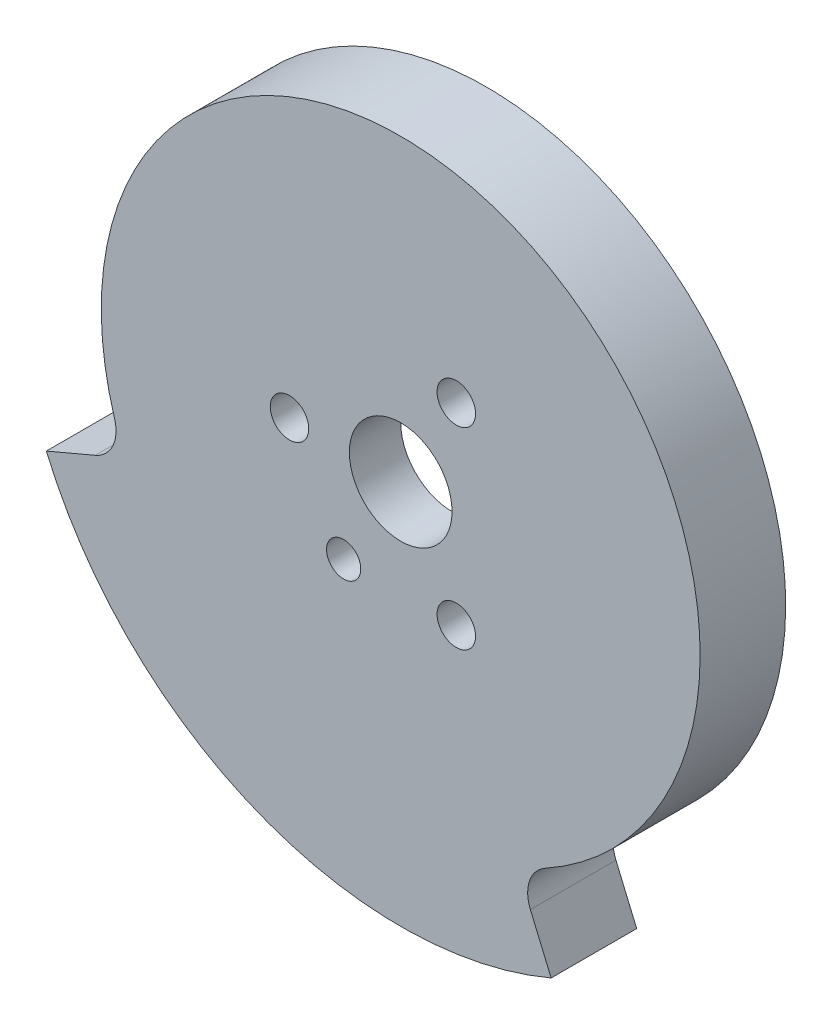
from build123d import *

# Parameters (mm, degrees)
ESQUISSE1_R             = 2.25
ESQUISSE1_R_2           = 6
ESQUISSE1_R_3           = 2
EXTRUSION1_DEPTH        = 10
ESQUISSE2_R             = 25
ENL_V_MAT_EXTRU_1_DEPTH = 4


with BuildPart() as part:
    # Esquisse1 → Extrusion1 (new body)
    with BuildSketch(Plane.XY):
        with BuildLine():
            Line((15.158152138, -35.710368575), (17.582900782, -41.422718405))
            ThreePointArc((17.582900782, -41.422718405), (-16.857296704, -41.723273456), (-41.422718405, -17.582900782))
            Line((-41.422718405, -17.582900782), (-35.710368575, -15.158152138))
            ThreePointArc((-35.710368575, -15.158152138), (-33.646394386, -13.163025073), (-33.450391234, -10.29909347))
            ThreePointArc((-33.450391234, -10.29909347), (13.11123077, 32.45143491), (16.907846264, -30.645142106))
            ThreePointArc((16.907846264, -30.645142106), (15.059385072, -32.841437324), (15.158152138, -35.710368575))
        make_face()
        with Locations((-13, 0)):
            Circle(ESQUISSE1_R, mode=Mode.SUBTRACT)
        with Locations((6.5, 11.258330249)):
            Circle(ESQUISSE1_R, mode=Mode.SUBTRACT)
        with Locations((6.5, -11.258330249)):
            Circle(ESQUISSE1_R, mode=Mode.SUBTRACT)
        Circle(ESQUISSE1_R_2, mode=Mode.SUBTRACT)
        with Locations((-6.670127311, -11.158378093)):
            Circle(ESQUISSE1_R_3, mode=Mode.SUBTRACT)
    extrude(amount=EXTRUSION1_DEPTH)

    # Esquisse2 → Enl_v. mat.-Extru.1 (cut)
    with BuildSketch(Plane(origin=(0, 0, 0), x_dir=(-1, 0, 0), z_dir=(0, 0, -1))):
        Circle(ESQUISSE2_R)
    extrude(amount=-ENL_V_MAT_EXTRU_1_DEPTH, mode=Mode.SUBTRACT)


solid = part.part
